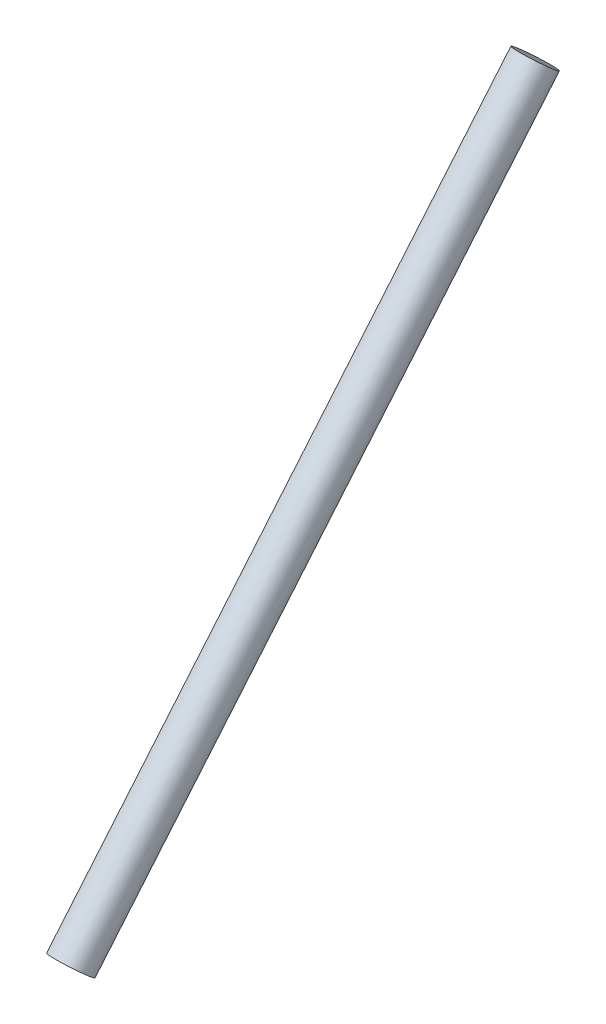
ISO-10303-21;
HEADER;
FILE_DESCRIPTION(('STEP AP214'),'2;1');
FILE_NAME('part.step','',(''),(''),'','','');
FILE_SCHEMA(('AUTOMOTIVE_DESIGN { 1 0 10303 214 1 1 1 1 }'));
ENDSEC;
DATA;
#1=APPLICATION_CONTEXT('core data for automotive mechanical design processes');
#2=APPLICATION_PROTOCOL_DEFINITION('international standard','automotive_design',2000,#1);
#3=PRODUCT_CONTEXT('',#1,'mechanical');
#4=PRODUCT('Part','Part','',(#3));
#5=PRODUCT_RELATED_PRODUCT_CATEGORY('part','',(#4));
#6=PRODUCT_DEFINITION_FORMATION('','',#4);
#7=PRODUCT_DEFINITION_CONTEXT('part definition',#1,'design');
#8=PRODUCT_DEFINITION('design','',#6,#7);
#9=PRODUCT_DEFINITION_SHAPE('','',#8);
#10=(LENGTH_UNIT() NAMED_UNIT(*) SI_UNIT(.MILLI.,.METRE.));
#11=(NAMED_UNIT(*) PLANE_ANGLE_UNIT() SI_UNIT($,.RADIAN.));
#12=(NAMED_UNIT(*) SI_UNIT($,.STERADIAN.) SOLID_ANGLE_UNIT());
#13=UNCERTAINTY_MEASURE_WITH_UNIT(LENGTH_MEASURE(1.E-05),#10,'distance_accuracy_value','');
#14=(GEOMETRIC_REPRESENTATION_CONTEXT(3) GLOBAL_UNCERTAINTY_ASSIGNED_CONTEXT((#13)) GLOBAL_UNIT_ASSIGNED_CONTEXT((#10,
#11,#12)) REPRESENTATION_CONTEXT('',''));
#15=CARTESIAN_POINT('',(0.,0.,0.));
#16=DIRECTION('',(0.,0.,1.));
#17=DIRECTION('',(1.,0.,0.));
#18=AXIS2_PLACEMENT_3D('',#15,#16,#17);
#19=CARTESIAN_POINT('',(-2.3142448,37.9086422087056,20.2336468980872));
#20=DIRECTION('',(0.,-0.766044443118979,0.642787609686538));
#21=DIRECTION('',(0.,-0.642787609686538,-0.766044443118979));
#22=AXIS2_PLACEMENT_3D('',#19,#20,#21);
#23=PLANE('',#22);
#24=CARTESIAN_POINT('',(-2.3142448,37.9086422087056,20.2336468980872));
#25=DIRECTION('',(0.,0.766044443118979,-0.642787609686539));
#26=DIRECTION('',(0.,0.642787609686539,0.766044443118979));
#27=AXIS2_PLACEMENT_3D('',#24,#25,#26);
#28=CIRCLE('',#27,0.4064);
#29=CARTESIAN_POINT('',(-2.3142448,38.1698710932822,20.5449673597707));
#30=VERTEX_POINT('',#29);
#31=EDGE_CURVE('E19',#30,#30,#28,.T.);
#32=ORIENTED_EDGE('',*,*,#31,.F.);
#33=EDGE_LOOP('',(#32));
#34=FACE_BOUND('',#33,.T.);
#35=ADVANCED_FACE('F15',(#34),#23,.T.);
#36=CARTESIAN_POINT('',(-2.3142448,49.5831595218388,10.4375637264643));
#37=DIRECTION('',(0.,-0.766044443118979,0.642787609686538));
#38=DIRECTION('',(0.,-0.642787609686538,-0.766044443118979));
#39=AXIS2_PLACEMENT_3D('',#36,#37,#38);
#40=PLANE('',#39);
#41=CARTESIAN_POINT('',(-2.3142448,49.5831595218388,10.4375637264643));
#42=DIRECTION('',(0.,0.766044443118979,-0.642787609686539));
#43=DIRECTION('',(0.,0.642787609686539,0.766044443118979));
#44=AXIS2_PLACEMENT_3D('',#41,#42,#43);
#45=CIRCLE('',#44,0.4064);
#46=CARTESIAN_POINT('',(-2.3142448,49.8443884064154,10.7488841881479));
#47=VERTEX_POINT('',#46);
#48=EDGE_CURVE('E10',#47,#47,#45,.F.);
#49=ORIENTED_EDGE('',*,*,#48,.F.);
#50=EDGE_LOOP('',(#49));
#51=FACE_BOUND('',#50,.T.);
#52=ADVANCED_FACE('F30',(#51),#40,.F.);
#53=CARTESIAN_POINT('',(-2.3142448,37.9086422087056,20.2336468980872));
#54=DIRECTION('',(0.,0.766044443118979,-0.642787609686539));
#55=DIRECTION('',(0.,0.642787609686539,0.766044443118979));
#56=AXIS2_PLACEMENT_3D('',#53,#54,#55);
#57=CYLINDRICAL_SURFACE('',#56,0.4064);
#58=ORIENTED_EDGE('',*,*,#31,.T.);
#59=EDGE_LOOP('',(#58));
#60=FACE_BOUND('',#59,.T.);
#61=ORIENTED_EDGE('',*,*,#48,.T.);
#62=EDGE_LOOP('',(#61));
#63=FACE_BOUND('',#62,.T.);
#64=ADVANCED_FACE('F17',(#60,#63),#57,.T.);
#65=CLOSED_SHELL('',(#35,#52,#64));
#66=MANIFOLD_SOLID_BREP('B1',#65);
#67=ADVANCED_BREP_SHAPE_REPRESENTATION('',(#18,#66),#14);
#68=SHAPE_DEFINITION_REPRESENTATION(#9,#67);
ENDSEC;
END-ISO-10303-21;
